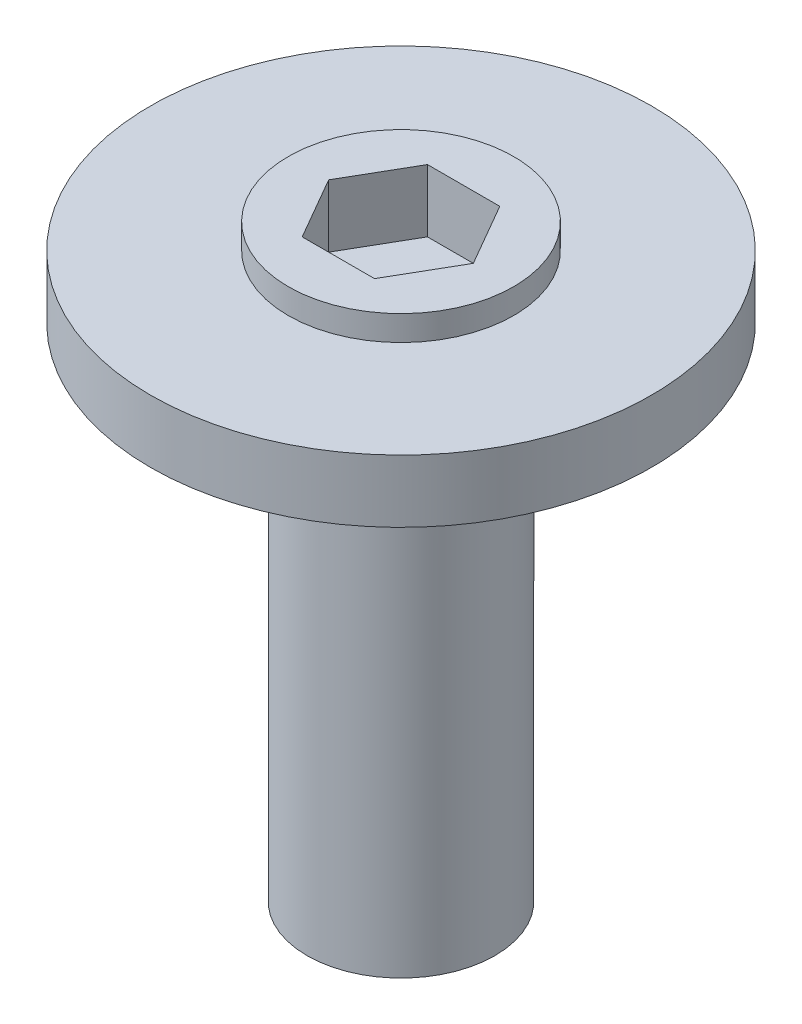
ISO-10303-21;
HEADER;
FILE_DESCRIPTION(('STEP AP214'),'2;1');
FILE_NAME('part.step','',(''),(''),'','','');
FILE_SCHEMA(('AUTOMOTIVE_DESIGN { 1 0 10303 214 1 1 1 1 }'));
ENDSEC;
DATA;
#1=APPLICATION_CONTEXT('core data for automotive mechanical design processes');
#2=APPLICATION_PROTOCOL_DEFINITION('international standard','automotive_design',2000,#1);
#3=PRODUCT_CONTEXT('',#1,'mechanical');
#4=PRODUCT('Part','Part','',(#3));
#5=PRODUCT_RELATED_PRODUCT_CATEGORY('part','',(#4));
#6=PRODUCT_DEFINITION_FORMATION('','',#4);
#7=PRODUCT_DEFINITION_CONTEXT('part definition',#1,'design');
#8=PRODUCT_DEFINITION('design','',#6,#7);
#9=PRODUCT_DEFINITION_SHAPE('','',#8);
#10=(LENGTH_UNIT() NAMED_UNIT(*) SI_UNIT(.MILLI.,.METRE.));
#11=(NAMED_UNIT(*) PLANE_ANGLE_UNIT() SI_UNIT($,.RADIAN.));
#12=(NAMED_UNIT(*) SI_UNIT($,.STERADIAN.) SOLID_ANGLE_UNIT());
#13=UNCERTAINTY_MEASURE_WITH_UNIT(LENGTH_MEASURE(1.E-05),#10,'distance_accuracy_value','');
#14=(GEOMETRIC_REPRESENTATION_CONTEXT(3) GLOBAL_UNCERTAINTY_ASSIGNED_CONTEXT((#13)) GLOBAL_UNIT_ASSIGNED_CONTEXT((#10,
#11,#12)) REPRESENTATION_CONTEXT('',''));
#15=CARTESIAN_POINT('',(0.,0.,0.));
#16=DIRECTION('',(0.,0.,1.));
#17=DIRECTION('',(1.,0.,0.));
#18=AXIS2_PLACEMENT_3D('',#15,#16,#17);
#19=CARTESIAN_POINT('',(0.,0.,0.));
#20=DIRECTION('',(0.,1.,0.));
#21=DIRECTION('',(0.,0.,1.));
#22=AXIS2_PLACEMENT_3D('',#19,#20,#21);
#23=PLANE('',#22);
#24=CARTESIAN_POINT('',(0.,0.,0.));
#25=DIRECTION('',(0.,1.,0.));
#26=DIRECTION('',(0.,0.,1.));
#27=AXIS2_PLACEMENT_3D('',#24,#25,#26);
#28=CIRCLE('',#27,4.);
#29=CARTESIAN_POINT('',(0.,0.,4.));
#30=VERTEX_POINT('',#29);
#31=EDGE_CURVE('E148',#30,#30,#28,.T.);
#32=ORIENTED_EDGE('',*,*,#31,.F.);
#33=EDGE_LOOP('',(#32));
#34=FACE_BOUND('',#33,.T.);
#35=CARTESIAN_POINT('',(0.,0.,0.));
#36=DIRECTION('',(0.,1.,0.));
#37=DIRECTION('',(0.,0.,1.));
#38=AXIS2_PLACEMENT_3D('',#35,#36,#37);
#39=CIRCLE('',#38,1.5);
#40=CARTESIAN_POINT('',(0.,0.,1.5));
#41=VERTEX_POINT('',#40);
#42=EDGE_CURVE('E11',#41,#41,#39,.F.);
#43=ORIENTED_EDGE('',*,*,#42,.F.);
#44=EDGE_LOOP('',(#43));
#45=FACE_BOUND('',#44,.T.);
#46=ADVANCED_FACE('F35',(#34,#45),#23,.F.);
#47=CARTESIAN_POINT('',(0.,1.4,0.));
#48=DIRECTION('',(0.,1.,0.));
#49=DIRECTION('',(0.,0.,1.));
#50=AXIS2_PLACEMENT_3D('',#47,#48,#49);
#51=PLANE('',#50);
#52=CARTESIAN_POINT('',(0.,1.4,0.));
#53=DIRECTION('',(0.,1.,0.));
#54=DIRECTION('',(0.,0.,1.));
#55=AXIS2_PLACEMENT_3D('',#52,#53,#54);
#56=CIRCLE('',#55,1.8);
#57=CARTESIAN_POINT('',(0.,1.4,1.8));
#58=VERTEX_POINT('',#57);
#59=EDGE_CURVE('E142',#58,#58,#56,.T.);
#60=ORIENTED_EDGE('',*,*,#59,.T.);
#61=EDGE_LOOP('',(#60));
#62=FACE_BOUND('',#61,.T.);
#63=DIRECTION('',(-0.5,0.,-0.866025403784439));
#64=VECTOR('',#63,1.);
#65=CARTESIAN_POINT('',(-0.866025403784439,1.4,0.5));
#66=LINE('',#65,#64);
#67=CARTESIAN_POINT('',(-0.577350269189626,1.4,1.));
#68=VERTEX_POINT('',#67);
#69=CARTESIAN_POINT('',(-1.15470053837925,1.4,0.));
#70=VERTEX_POINT('',#69);
#71=EDGE_CURVE('E131',#68,#70,#66,.T.);
#72=ORIENTED_EDGE('',*,*,#71,.T.);
#73=DIRECTION('',(0.5,0.,-0.866025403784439));
#74=VECTOR('',#73,1.);
#75=CARTESIAN_POINT('',(-0.866025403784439,1.4,-0.5));
#76=LINE('',#75,#74);
#77=CARTESIAN_POINT('',(-0.577350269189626,1.4,-1.));
#78=VERTEX_POINT('',#77);
#79=EDGE_CURVE('E50',#70,#78,#76,.T.);
#80=ORIENTED_EDGE('',*,*,#79,.T.);
#81=DIRECTION('',(1.,0.,0.));
#82=VECTOR('',#81,1.);
#83=CARTESIAN_POINT('',(0.,1.4,-1.));
#84=LINE('',#83,#82);
#85=CARTESIAN_POINT('',(0.577350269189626,1.4,-1.));
#86=VERTEX_POINT('',#85);
#87=EDGE_CURVE('E121',#78,#86,#84,.T.);
#88=ORIENTED_EDGE('',*,*,#87,.T.);
#89=DIRECTION('',(0.5,0.,0.866025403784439));
#90=VECTOR('',#89,1.);
#91=CARTESIAN_POINT('',(0.866025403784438,1.4,-0.5));
#92=LINE('',#91,#90);
#93=CARTESIAN_POINT('',(1.15470053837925,1.4,0.));
#94=VERTEX_POINT('',#93);
#95=EDGE_CURVE('E125',#86,#94,#92,.T.);
#96=ORIENTED_EDGE('',*,*,#95,.T.);
#97=DIRECTION('',(-0.5,0.,0.866025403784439));
#98=VECTOR('',#97,1.);
#99=CARTESIAN_POINT('',(0.866025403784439,1.4,0.5));
#100=LINE('',#99,#98);
#101=CARTESIAN_POINT('',(0.577350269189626,1.4,1.));
#102=VERTEX_POINT('',#101);
#103=EDGE_CURVE('E128',#94,#102,#100,.T.);
#104=ORIENTED_EDGE('',*,*,#103,.T.);
#105=DIRECTION('',(-1.,0.,0.));
#106=VECTOR('',#105,1.);
#107=CARTESIAN_POINT('',(0.,1.4,1.));
#108=LINE('',#107,#106);
#109=EDGE_CURVE('E111',#102,#68,#108,.T.);
#110=ORIENTED_EDGE('',*,*,#109,.T.);
#111=EDGE_LOOP('',(#72,#80,#88,#96,#104,#110));
#112=FACE_BOUND('',#111,.T.);
#113=ADVANCED_FACE('F156',(#62,#112),#51,.T.);
#114=CARTESIAN_POINT('',(0.,1.,0.));
#115=DIRECTION('',(0.,1.,0.));
#116=DIRECTION('',(0.,0.,1.));
#117=AXIS2_PLACEMENT_3D('',#114,#115,#116);
#118=PLANE('',#117);
#119=CARTESIAN_POINT('',(0.,1.,0.));
#120=DIRECTION('',(0.,1.,0.));
#121=DIRECTION('',(0.,0.,1.));
#122=AXIS2_PLACEMENT_3D('',#119,#120,#121);
#123=CIRCLE('',#122,4.);
#124=CARTESIAN_POINT('',(0.,1.,4.));
#125=VERTEX_POINT('',#124);
#126=EDGE_CURVE('E43',#125,#125,#123,.T.);
#127=ORIENTED_EDGE('',*,*,#126,.T.);
#128=EDGE_LOOP('',(#127));
#129=FACE_BOUND('',#128,.T.);
#130=CARTESIAN_POINT('',(0.,1.,0.));
#131=DIRECTION('',(0.,1.,0.));
#132=DIRECTION('',(0.,0.,1.));
#133=AXIS2_PLACEMENT_3D('',#130,#131,#132);
#134=CIRCLE('',#133,1.8);
#135=CARTESIAN_POINT('',(0.,1.,1.8));
#136=VERTEX_POINT('',#135);
#137=EDGE_CURVE('E145',#136,#136,#134,.F.);
#138=ORIENTED_EDGE('',*,*,#137,.T.);
#139=EDGE_LOOP('',(#138));
#140=FACE_BOUND('',#139,.T.);
#141=ADVANCED_FACE('F194',(#129,#140),#118,.T.);
#142=CARTESIAN_POINT('',(0.,1.,0.));
#143=DIRECTION('',(0.,-1.,0.));
#144=DIRECTION('',(0.,0.,-1.));
#145=AXIS2_PLACEMENT_3D('',#142,#143,#144);
#146=CYLINDRICAL_SURFACE('',#145,4.);
#147=ORIENTED_EDGE('',*,*,#126,.F.);
#148=EDGE_LOOP('',(#147));
#149=FACE_BOUND('',#148,.T.);
#150=ORIENTED_EDGE('',*,*,#31,.T.);
#151=EDGE_LOOP('',(#150));
#152=FACE_BOUND('',#151,.T.);
#153=ADVANCED_FACE('F37',(#149,#152),#146,.T.);
#154=CARTESIAN_POINT('',(0.,1.4,0.));
#155=DIRECTION('',(0.,-1.,0.));
#156=DIRECTION('',(0.,0.,-1.));
#157=AXIS2_PLACEMENT_3D('',#154,#155,#156);
#158=CYLINDRICAL_SURFACE('',#157,1.8);
#159=ORIENTED_EDGE('',*,*,#137,.F.);
#160=EDGE_LOOP('',(#159));
#161=FACE_BOUND('',#160,.T.);
#162=ORIENTED_EDGE('',*,*,#59,.F.);
#163=EDGE_LOOP('',(#162));
#164=FACE_BOUND('',#163,.T.);
#165=ADVANCED_FACE('F191',(#161,#164),#158,.T.);
#166=CARTESIAN_POINT('',(-0.866025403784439,0.4,-0.5));
#167=DIRECTION('',(0.866025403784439,0.,0.5));
#168=DIRECTION('',(0.5,0.,-0.866025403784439));
#169=AXIS2_PLACEMENT_3D('',#166,#167,#168);
#170=PLANE('',#169);
#171=ORIENTED_EDGE('',*,*,#79,.F.);
#172=DIRECTION('',(0.,1.,0.));
#173=VECTOR('',#172,1.);
#174=CARTESIAN_POINT('',(-1.15470053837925,0.4,0.));
#175=LINE('',#174,#173);
#176=CARTESIAN_POINT('',(-1.15470053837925,0.4,0.));
#177=VERTEX_POINT('',#176);
#178=EDGE_CURVE('E116',#177,#70,#175,.T.);
#179=ORIENTED_EDGE('',*,*,#178,.F.);
#180=DIRECTION('',(0.5,0.,-0.866025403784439));
#181=VECTOR('',#180,1.);
#182=CARTESIAN_POINT('',(-0.866025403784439,0.4,-0.5));
#183=LINE('',#182,#181);
#184=CARTESIAN_POINT('',(-0.577350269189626,0.4,-1.));
#185=VERTEX_POINT('',#184);
#186=EDGE_CURVE('E134',#177,#185,#183,.T.);
#187=ORIENTED_EDGE('',*,*,#186,.T.);
#188=DIRECTION('',(0.,1.,0.));
#189=VECTOR('',#188,1.);
#190=CARTESIAN_POINT('',(-0.577350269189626,0.4,-1.));
#191=LINE('',#190,#189);
#192=EDGE_CURVE('E140',#185,#78,#191,.T.);
#193=ORIENTED_EDGE('',*,*,#192,.T.);
#194=EDGE_LOOP('',(#171,#179,#187,#193));
#195=FACE_BOUND('',#194,.T.);
#196=ADVANCED_FACE('F187',(#195),#170,.T.);
#197=CARTESIAN_POINT('',(0.,0.4,-1.));
#198=DIRECTION('',(0.,0.,1.));
#199=DIRECTION('',(1.,0.,0.));
#200=AXIS2_PLACEMENT_3D('',#197,#198,#199);
#201=PLANE('',#200);
#202=ORIENTED_EDGE('',*,*,#87,.F.);
#203=ORIENTED_EDGE('',*,*,#192,.F.);
#204=DIRECTION('',(1.,0.,0.));
#205=VECTOR('',#204,1.);
#206=CARTESIAN_POINT('',(0.,0.4,-1.));
#207=LINE('',#206,#205);
#208=CARTESIAN_POINT('',(0.577350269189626,0.4,-1.));
#209=VERTEX_POINT('',#208);
#210=EDGE_CURVE('E89',#185,#209,#207,.T.);
#211=ORIENTED_EDGE('',*,*,#210,.T.);
#212=DIRECTION('',(0.,1.,0.));
#213=VECTOR('',#212,1.);
#214=CARTESIAN_POINT('',(0.577350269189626,0.4,-1.));
#215=LINE('',#214,#213);
#216=EDGE_CURVE('E138',#209,#86,#215,.T.);
#217=ORIENTED_EDGE('',*,*,#216,.T.);
#218=EDGE_LOOP('',(#202,#203,#211,#217));
#219=FACE_BOUND('',#218,.T.);
#220=ADVANCED_FACE('F183',(#219),#201,.T.);
#221=CARTESIAN_POINT('',(0.866025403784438,0.4,-0.5));
#222=DIRECTION('',(-0.866025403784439,0.,0.5));
#223=DIRECTION('',(0.5,0.,0.866025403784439));
#224=AXIS2_PLACEMENT_3D('',#221,#222,#223);
#225=PLANE('',#224);
#226=ORIENTED_EDGE('',*,*,#95,.F.);
#227=ORIENTED_EDGE('',*,*,#216,.F.);
#228=DIRECTION('',(0.5,0.,0.866025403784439));
#229=VECTOR('',#228,1.);
#230=CARTESIAN_POINT('',(0.866025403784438,0.4,-0.5));
#231=LINE('',#230,#229);
#232=CARTESIAN_POINT('',(1.15470053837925,0.4,0.));
#233=VERTEX_POINT('',#232);
#234=EDGE_CURVE('E107',#209,#233,#231,.T.);
#235=ORIENTED_EDGE('',*,*,#234,.T.);
#236=DIRECTION('',(0.,1.,0.));
#237=VECTOR('',#236,1.);
#238=CARTESIAN_POINT('',(1.15470053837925,0.4,0.));
#239=LINE('',#238,#237);
#240=EDGE_CURVE('E104',#233,#94,#239,.T.);
#241=ORIENTED_EDGE('',*,*,#240,.T.);
#242=EDGE_LOOP('',(#226,#227,#235,#241));
#243=FACE_BOUND('',#242,.T.);
#244=ADVANCED_FACE('F180',(#243),#225,.T.);
#245=CARTESIAN_POINT('',(0.866025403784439,0.4,0.5));
#246=DIRECTION('',(-0.866025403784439,0.,-0.5));
#247=DIRECTION('',(-0.5,0.,0.866025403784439));
#248=AXIS2_PLACEMENT_3D('',#245,#246,#247);
#249=PLANE('',#248);
#250=ORIENTED_EDGE('',*,*,#103,.F.);
#251=ORIENTED_EDGE('',*,*,#240,.F.);
#252=DIRECTION('',(-0.5,0.,0.866025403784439));
#253=VECTOR('',#252,1.);
#254=CARTESIAN_POINT('',(0.866025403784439,0.4,0.5));
#255=LINE('',#254,#253);
#256=CARTESIAN_POINT('',(0.577350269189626,0.4,1.));
#257=VERTEX_POINT('',#256);
#258=EDGE_CURVE('E99',#233,#257,#255,.T.);
#259=ORIENTED_EDGE('',*,*,#258,.T.);
#260=DIRECTION('',(0.,1.,0.));
#261=VECTOR('',#260,1.);
#262=CARTESIAN_POINT('',(0.577350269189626,0.4,1.));
#263=LINE('',#262,#261);
#264=EDGE_CURVE('E103',#257,#102,#263,.T.);
#265=ORIENTED_EDGE('',*,*,#264,.T.);
#266=EDGE_LOOP('',(#250,#251,#259,#265));
#267=FACE_BOUND('',#266,.T.);
#268=ADVANCED_FACE('F102',(#267),#249,.T.);
#269=CARTESIAN_POINT('',(0.,0.4,1.));
#270=DIRECTION('',(0.,0.,-1.));
#271=DIRECTION('',(-1.,0.,0.));
#272=AXIS2_PLACEMENT_3D('',#269,#270,#271);
#273=PLANE('',#272);
#274=ORIENTED_EDGE('',*,*,#109,.F.);
#275=ORIENTED_EDGE('',*,*,#264,.F.);
#276=DIRECTION('',(-1.,0.,0.));
#277=VECTOR('',#276,1.);
#278=CARTESIAN_POINT('',(0.,0.4,1.));
#279=LINE('',#278,#277);
#280=CARTESIAN_POINT('',(-0.577350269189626,0.4,1.));
#281=VERTEX_POINT('',#280);
#282=EDGE_CURVE('E106',#257,#281,#279,.T.);
#283=ORIENTED_EDGE('',*,*,#282,.T.);
#284=DIRECTION('',(0.,1.,0.));
#285=VECTOR('',#284,1.);
#286=CARTESIAN_POINT('',(-0.577350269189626,0.4,1.));
#287=LINE('',#286,#285);
#288=EDGE_CURVE('E80',#281,#68,#287,.T.);
#289=ORIENTED_EDGE('',*,*,#288,.T.);
#290=EDGE_LOOP('',(#274,#275,#283,#289));
#291=FACE_BOUND('',#290,.T.);
#292=ADVANCED_FACE('F109',(#291),#273,.T.);
#293=CARTESIAN_POINT('',(-0.866025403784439,0.4,0.5));
#294=DIRECTION('',(0.866025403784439,0.,-0.5));
#295=DIRECTION('',(-0.5,0.,-0.866025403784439));
#296=AXIS2_PLACEMENT_3D('',#293,#294,#295);
#297=PLANE('',#296);
#298=ORIENTED_EDGE('',*,*,#71,.F.);
#299=ORIENTED_EDGE('',*,*,#288,.F.);
#300=DIRECTION('',(-0.5,0.,-0.866025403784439));
#301=VECTOR('',#300,1.);
#302=CARTESIAN_POINT('',(-0.866025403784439,0.4,0.5));
#303=LINE('',#302,#301);
#304=EDGE_CURVE('E58',#281,#177,#303,.T.);
#305=ORIENTED_EDGE('',*,*,#304,.T.);
#306=ORIENTED_EDGE('',*,*,#178,.T.);
#307=EDGE_LOOP('',(#298,#299,#305,#306));
#308=FACE_BOUND('',#307,.T.);
#309=ADVANCED_FACE('F170',(#308),#297,.T.);
#310=CARTESIAN_POINT('',(0.,0.4,0.));
#311=DIRECTION('',(0.,-1.,0.));
#312=DIRECTION('',(0.,0.,-1.));
#313=AXIS2_PLACEMENT_3D('',#310,#311,#312);
#314=PLANE('',#313);
#315=ORIENTED_EDGE('',*,*,#186,.F.);
#316=ORIENTED_EDGE('',*,*,#304,.F.);
#317=ORIENTED_EDGE('',*,*,#282,.F.);
#318=ORIENTED_EDGE('',*,*,#258,.F.);
#319=ORIENTED_EDGE('',*,*,#234,.F.);
#320=ORIENTED_EDGE('',*,*,#210,.F.);
#321=EDGE_LOOP('',(#315,#316,#317,#318,#319,#320));
#322=FACE_BOUND('',#321,.T.);
#323=ADVANCED_FACE('F114',(#322),#314,.F.);
#324=CARTESIAN_POINT('',(0.,-8.,0.));
#325=DIRECTION('',(0.,1.,0.));
#326=DIRECTION('',(0.,0.,1.));
#327=AXIS2_PLACEMENT_3D('',#324,#325,#326);
#328=CYLINDRICAL_SURFACE('',#327,1.5);
#329=CARTESIAN_POINT('',(0.,-8.,0.));
#330=DIRECTION('',(0.,-1.,0.));
#331=DIRECTION('',(0.,0.,-1.));
#332=AXIS2_PLACEMENT_3D('',#329,#330,#331);
#333=CIRCLE('',#332,1.5);
#334=CARTESIAN_POINT('',(0.,-8.,-1.5));
#335=VERTEX_POINT('',#334);
#336=EDGE_CURVE('E122',#335,#335,#333,.T.);
#337=ORIENTED_EDGE('',*,*,#336,.F.);
#338=EDGE_LOOP('',(#337));
#339=FACE_BOUND('',#338,.T.);
#340=ORIENTED_EDGE('',*,*,#42,.T.);
#341=EDGE_LOOP('',(#340));
#342=FACE_BOUND('',#341,.T.);
#343=ADVANCED_FACE('F159',(#339,#342),#328,.T.);
#344=CARTESIAN_POINT('',(0.,-8.,0.));
#345=DIRECTION('',(0.,-1.,0.));
#346=DIRECTION('',(0.,0.,-1.));
#347=AXIS2_PLACEMENT_3D('',#344,#345,#346);
#348=PLANE('',#347);
#349=ORIENTED_EDGE('',*,*,#336,.T.);
#350=EDGE_LOOP('',(#349));
#351=FACE_BOUND('',#350,.T.);
#352=ADVANCED_FACE('F161',(#351),#348,.T.);
#353=CLOSED_SHELL('',(#46,#113,#141,#153,#165,#196,#220,#244,#268,#292,#309,#323,#343,#352));
#354=MANIFOLD_SOLID_BREP('B2',#353);
#355=ADVANCED_BREP_SHAPE_REPRESENTATION('',(#18,#354),#14);
#356=SHAPE_DEFINITION_REPRESENTATION(#9,#355);
ENDSEC;
END-ISO-10303-21;
